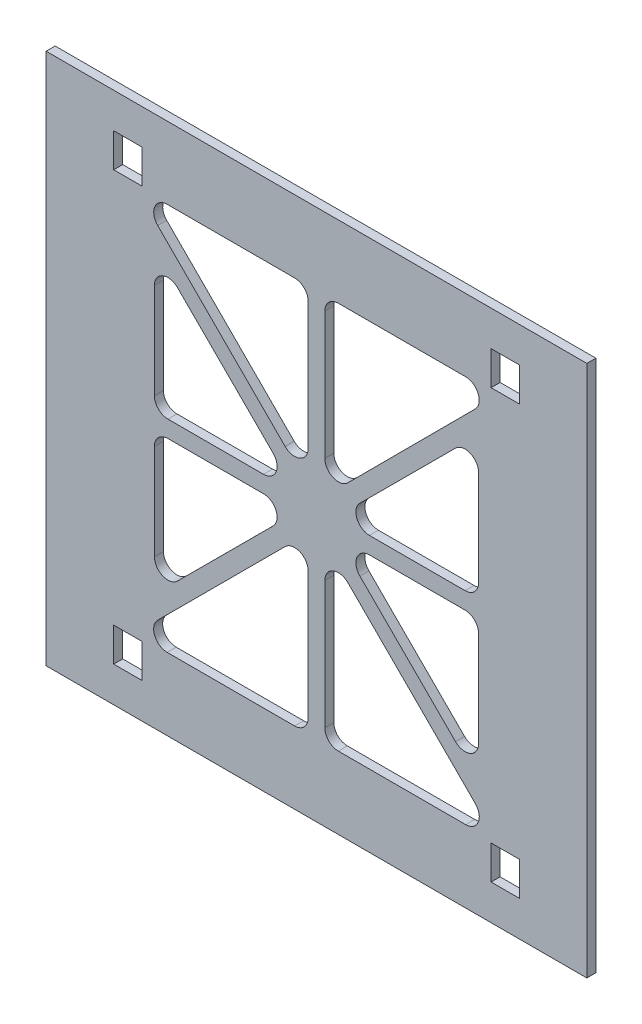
from build123d import *

# Parameters (mm, degrees)
MODEL_W             = 95.984
MODEL_H             = 94.4896
MODEL_W_2           = 5.0008
MODEL_H_2           = 6.00096
BOSS_EXTRUDE1_DEPTH = 1.6


with BuildPart() as part:
    # Model → Boss-Extrude1 (new body)
    with BuildSketch(Plane.XY):
        with Locations((46.976, 127.3668)):
            Rectangle(MODEL_W, MODEL_H)
        with Locations((13.4764, 89.380889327)):
            Rectangle(MODEL_W_2, MODEL_H_2, mode=Mode.SUBTRACT)
        with Locations((80.4756, 89.380889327)):
            Rectangle(MODEL_W_2, MODEL_H_2, mode=Mode.SUBTRACT)
        with Locations((80.4756, 165.379929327)):
            Rectangle(MODEL_W_2, MODEL_H_2, mode=Mode.SUBTRACT)
        with Locations((13.4764, 165.379929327)):
            Rectangle(MODEL_W_2, MODEL_H_2, mode=Mode.SUBTRACT)
        with BuildLine():
            ThreePointArc((71.652206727, 149.922703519), (74.267374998, 150.441756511), (75.748316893, 148.224701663))
            Line((75.748316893, 148.224701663), (75.748316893, 131.2636))
            ThreePointArc((75.748316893, 131.2636), (75.045373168, 129.566543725), (73.348316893, 128.8636))
            Line((73.348316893, 128.8636), (56.368298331, 128.8636))
            ThreePointArc((56.368298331, 128.8636), (54.150731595, 130.345777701), (54.672188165, 132.961601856))
            Line((54.672188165, 132.961601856), (71.652206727, 149.922703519))
        make_face(mode=Mode.SUBTRACT)
        with BuildLine():
            ThreePointArc((48.4576, 159.39720821), (49.160543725, 161.094264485), (50.8576, 161.79720821))
            Line((50.8576, 161.79720821), (73.460496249, 161.79720821))
            ThreePointArc((73.460496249, 161.79720821), (75.677309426, 160.316849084), (75.159389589, 157.701990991))
            Line((75.159389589, 157.701990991), (52.55649334, 135.050079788))
            ThreePointArc((52.55649334, 135.050079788), (49.940360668, 134.527489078), (48.4576, 136.745297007))
            Line((48.4576, 136.745297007), (48.4576, 159.39720821))
        make_face(mode=Mode.SUBTRACT)
        with BuildLine():
            ThreePointArc((45.4944, 95.333270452), (44.791456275, 93.636214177), (43.0944, 92.933270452))
            Line((43.0944, 92.933270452), (20.466983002, 92.933270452))
            ThreePointArc((20.466983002, 92.933270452), (18.249672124, 94.414830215), (18.769926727, 97.030326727))
            Line((18.769926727, 97.030326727), (41.397343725, 119.657743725))
            ThreePointArc((41.397343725, 119.657743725), (44.012840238, 120.177998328), (45.4944, 117.96068745))
            Line((45.4944, 117.96068745), (45.4944, 95.333270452))
        make_face(mode=Mode.SUBTRACT)
        with BuildLine():
            ThreePointArc((37.583689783, 125.8716), (39.801242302, 124.389456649), (39.279852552, 121.77365069))
            Line((39.279852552, 121.77365069), (22.300359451, 104.812022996))
            ThreePointArc((22.300359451, 104.812022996), (19.685172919, 104.292903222), (18.204196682, 106.509972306))
            Line((18.204196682, 106.509972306), (18.204196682, 123.4716))
            ThreePointArc((18.204196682, 123.4716), (18.907140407, 125.168656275), (20.604196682, 125.8716))
            Line((20.604196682, 125.8716), (37.583689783, 125.8716))
        make_face(mode=Mode.SUBTRACT)
        with BuildLine():
            ThreePointArc((48.4576, 117.988089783), (49.939743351, 120.205642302), (52.55554931, 119.684252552))
            Line((52.55554931, 119.684252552), (75.171052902, 97.044928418))
            ThreePointArc((75.171052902, 97.044928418), (75.690172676, 94.429741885), (73.473103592, 92.948765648))
            Line((73.473103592, 92.948765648), (50.8576, 92.948765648))
            ThreePointArc((50.8576, 92.948765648), (49.160543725, 93.651709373), (48.4576, 95.348765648))
            Line((48.4576, 95.348765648), (48.4576, 117.988089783))
        make_face(mode=Mode.SUBTRACT)
        with BuildLine():
            ThreePointArc((73.347803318, 125.8716), (75.044859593, 125.168656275), (75.747803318, 123.4716))
            Line((75.747803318, 123.4716), (75.747803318, 106.509972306))
            ThreePointArc((75.747803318, 106.509972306), (74.266827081, 104.292903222), (71.651640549, 104.812022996))
            Line((71.651640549, 104.812022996), (54.672147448, 121.77365069))
            ThreePointArc((54.672147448, 121.77365069), (54.150757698, 124.389456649), (56.368310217, 125.8716))
            Line((56.368310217, 125.8716), (73.347803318, 125.8716))
        make_face(mode=Mode.SUBTRACT)
        with BuildLine():
            ThreePointArc((20.603683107, 128.8636), (18.906626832, 129.566543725), (18.203683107, 131.2636))
            Line((18.203683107, 131.2636), (18.203683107, 148.224701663))
            ThreePointArc((18.203683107, 148.224701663), (19.684625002, 150.441756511), (22.299793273, 149.922703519))
            Line((22.299793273, 149.922703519), (39.279811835, 132.961601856))
            ThreePointArc((39.279811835, 132.961601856), (39.801268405, 130.345777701), (37.583701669, 128.8636))
            Line((37.583701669, 128.8636), (20.603683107, 128.8636))
        make_face(mode=Mode.SUBTRACT)
        with BuildLine():
            ThreePointArc((45.4944, 136.772728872), (44.012222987, 134.555162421), (41.396399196, 135.076617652))
            Line((41.396399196, 135.076617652), (18.781582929, 157.716628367))
            ThreePointArc((18.781582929, 157.716628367), (18.262528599, 160.331797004), (20.479583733, 161.812739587))
            Line((20.479583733, 161.812739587), (43.0944, 161.812739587))
            ThreePointArc((43.0944, 161.812739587), (44.791456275, 161.109795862), (45.4944, 159.412739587))
            Line((45.4944, 159.412739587), (45.4944, 136.772728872))
        make_face(mode=Mode.SUBTRACT)
    extrude(amount=-BOSS_EXTRUDE1_DEPTH)


solid = part.part
